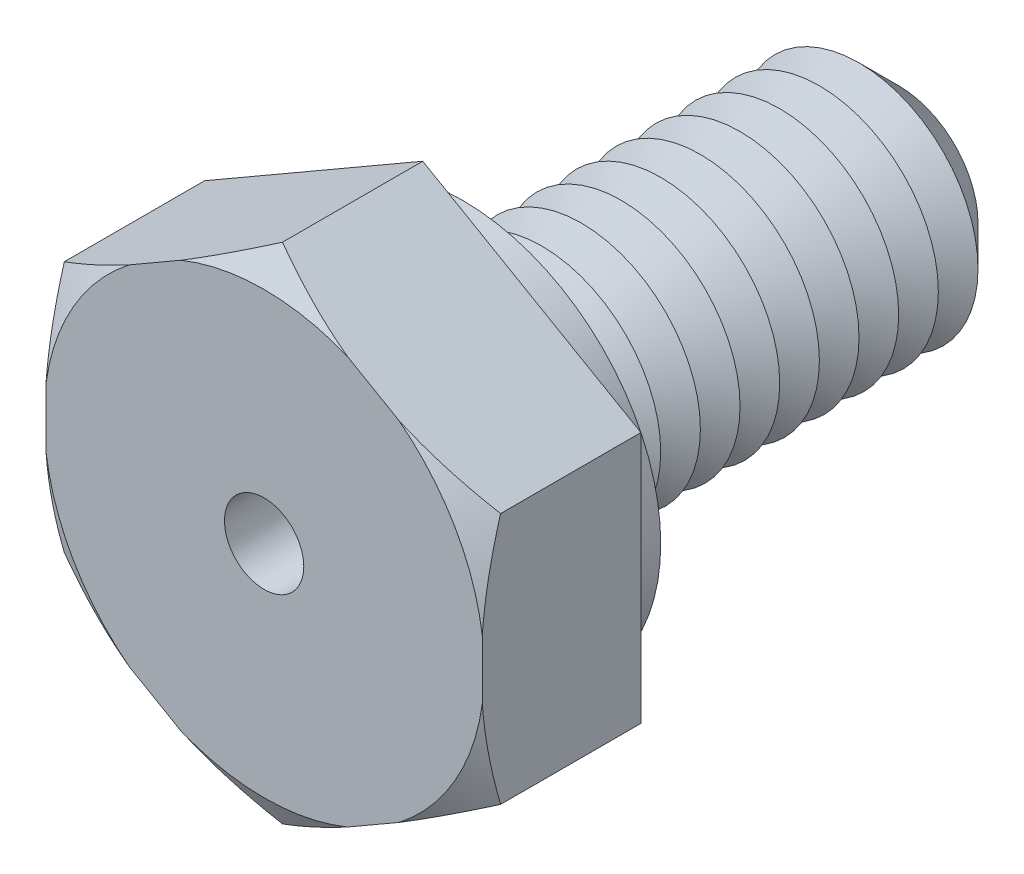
from build123d import *

# Parameters (mm, degrees)
BOSS_EXTRUDE1_DEPTH = 2
SKETCH3_R           = 1.5
BOSS_EXTRUDE2_DEPTH = 6
SKETCH4_R           = 2.5
BOSS_EXTRUDE3_DEPTH = 0.5
CHAMFER1_SIZE       = 0.5
LPATTERN1_COUNT     = 10
LPATTERN1_PITCH     = 0.5
SKETCH8_R           = 0.5
CUT_EXTRUDE1_DEPTH  = 8


with BuildPart() as part:
    # Sketch2 → Boss-Extrude1 (new body)
    with BuildSketch(Plane.XY):
        Polygon((0, 3.175426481), (-2.75, 1.58771324), (-2.75, -1.58771324), (0, -3.175426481), (2.75, -1.58771324), (2.75, 1.58771324), align=None)
    extrude(amount=BOSS_EXTRUDE1_DEPTH)

    # Sketch3 → Boss-Extrude2 (add)
    with BuildSketch(Plane(origin=(0, 0, 0), x_dir=(-1, 0, 0), z_dir=(0, 0, -1))):
        Circle(SKETCH3_R)
    extrude(amount=BOSS_EXTRUDE2_DEPTH)

    # Sketch4 → Boss-Extrude3 (add)
    with BuildSketch(Plane(origin=(0, 0, 0), x_dir=(-1, 0, 0), z_dir=(0, 0, -1))):
        with Locations(Location((0, 0, 0), (0, 0, 180))):
            Circle(SKETCH4_R)
    extrude(amount=BOSS_EXTRUDE3_DEPTH)

    # Chamfer1
    chamfer1_edges = [part.edges().sort_by_distance(p)[0] for p in [
        (1.5, 0, -6),
    ]]
    chamfer(chamfer1_edges, length=CHAMFER1_SIZE)

    # Sketch6 → Cut-Revolve1 (revolve, cut)
    with BuildSketch(Plane(origin=(0, 0, 0), x_dir=(0, 0, -1), z_dir=(1, 0, 0)), mode=Mode.PRIVATE) as cut_revolve1_sk:
        Polygon((0.5, 1.5), (0.75, 1.066987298), (1, 1.5), align=None)
    cut_revolve1 = revolve(cut_revolve1_sk.sketch.rotate(Axis((0, 0, 3.211670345), (0, 0, -1)), 90), axis=Axis((0, 0, 3.211670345), (0, 0, -1)), mode=Mode.SUBTRACT)

    # LPattern1: Cut-Revolve1 ×10
    with Locations(*[(0, 0, -i * LPATTERN1_PITCH) for i in range(1, LPATTERN1_COUNT)]):
        add(cut_revolve1, mode=Mode.SUBTRACT)

    # Sketch7 → Cut-Revolve2 (revolve, cut)
    with BuildSketch(Plane(origin=(0, 0, 0), x_dir=(0, 0, -1), z_dir=(1, 0, 0)), mode=Mode.PRIVATE) as cut_revolve2_sk:
        Polygon((-2, 3.175426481), (-2, 2.775426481), (-1.769059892, 3.175426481), align=None)
    revolve(cut_revolve2_sk.sketch.rotate(Axis((0, 0, 3.211670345), (0, 0, -1)), 90), axis=Axis((0, 0, 3.211670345), (0, 0, -1)), mode=Mode.SUBTRACT)

    # Sketch8 → Cut-Extrude1 (cut)
    with BuildSketch(Plane.XY.offset(2)):
        Circle(SKETCH8_R)
    extrude(amount=-CUT_EXTRUDE1_DEPTH, mode=Mode.SUBTRACT)


solid = part.part
